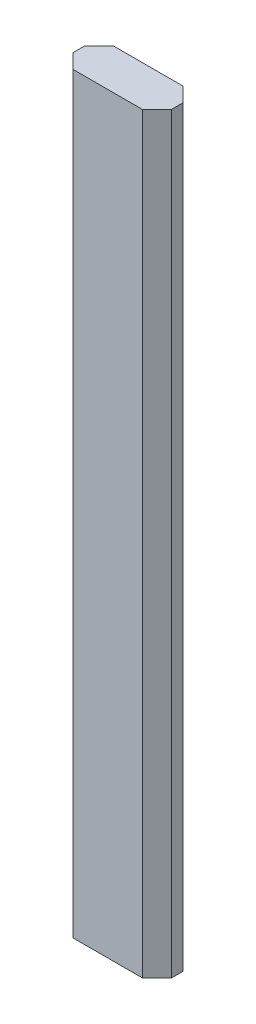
ISO-10303-21;
HEADER;
FILE_DESCRIPTION(('STEP AP214'),'2;1');
FILE_NAME('part.step','',(''),(''),'','','');
FILE_SCHEMA(('AUTOMOTIVE_DESIGN { 1 0 10303 214 1 1 1 1 }'));
ENDSEC;
DATA;
#1=APPLICATION_CONTEXT('core data for automotive mechanical design processes');
#2=APPLICATION_PROTOCOL_DEFINITION('international standard','automotive_design',2000,#1);
#3=PRODUCT_CONTEXT('',#1,'mechanical');
#4=PRODUCT('Part','Part','',(#3));
#5=PRODUCT_RELATED_PRODUCT_CATEGORY('part','',(#4));
#6=PRODUCT_DEFINITION_FORMATION('','',#4);
#7=PRODUCT_DEFINITION_CONTEXT('part definition',#1,'design');
#8=PRODUCT_DEFINITION('design','',#6,#7);
#9=PRODUCT_DEFINITION_SHAPE('','',#8);
#10=(LENGTH_UNIT() NAMED_UNIT(*) SI_UNIT(.MILLI.,.METRE.));
#11=(NAMED_UNIT(*) PLANE_ANGLE_UNIT() SI_UNIT($,.RADIAN.));
#12=(NAMED_UNIT(*) SI_UNIT($,.STERADIAN.) SOLID_ANGLE_UNIT());
#13=UNCERTAINTY_MEASURE_WITH_UNIT(LENGTH_MEASURE(1.E-05),#10,'distance_accuracy_value','');
#14=(GEOMETRIC_REPRESENTATION_CONTEXT(3) GLOBAL_UNCERTAINTY_ASSIGNED_CONTEXT((#13)) GLOBAL_UNIT_ASSIGNED_CONTEXT((#10,
#11,#12)) REPRESENTATION_CONTEXT('',''));
#15=CARTESIAN_POINT('',(0.,0.,0.));
#16=DIRECTION('',(0.,0.,1.));
#17=DIRECTION('',(1.,0.,0.));
#18=AXIS2_PLACEMENT_3D('',#15,#16,#17);
#19=CARTESIAN_POINT('',(-111.749922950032,130.,-50.1029826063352));
#20=DIRECTION('',(1.,0.,0.));
#21=DIRECTION('',(0.,0.,-1.));
#22=AXIS2_PLACEMENT_3D('',#19,#20,#21);
#23=PLANE('',#22);
#24=DIRECTION('',(0.,0.,1.));
#25=VECTOR('',#24,1.);
#26=CARTESIAN_POINT('',(-111.749922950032,0.,-50.1029826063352));
#27=LINE('',#26,#25);
#28=CARTESIAN_POINT('',(-111.749922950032,0.,-54.6029826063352));
#29=VERTEX_POINT('',#28);
#30=CARTESIAN_POINT('',(-111.749922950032,0.,-52.6029826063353));
#31=VERTEX_POINT('',#30);
#32=EDGE_CURVE('E163',#29,#31,#27,.T.);
#33=ORIENTED_EDGE('',*,*,#32,.T.);
#34=DIRECTION('',(0.,1.,0.));
#35=VECTOR('',#34,1.);
#36=CARTESIAN_POINT('',(-111.749922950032,130.,-52.6029826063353));
#37=LINE('',#36,#35);
#38=CARTESIAN_POINT('',(-111.749922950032,130.,-52.6029826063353));
#39=VERTEX_POINT('',#38);
#40=EDGE_CURVE('E203',#31,#39,#37,.T.);
#41=ORIENTED_EDGE('',*,*,#40,.T.);
#42=DIRECTION('',(0.,0.,1.));
#43=VECTOR('',#42,1.);
#44=CARTESIAN_POINT('',(-111.749922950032,130.,-50.1029826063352));
#45=LINE('',#44,#43);
#46=CARTESIAN_POINT('',(-111.749922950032,130.,-54.6029826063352));
#47=VERTEX_POINT('',#46);
#48=EDGE_CURVE('E167',#47,#39,#45,.T.);
#49=ORIENTED_EDGE('',*,*,#48,.F.);
#50=DIRECTION('',(0.,-1.,0.));
#51=VECTOR('',#50,1.);
#52=CARTESIAN_POINT('',(-111.749922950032,130.,-54.6029826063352));
#53=LINE('',#52,#51);
#54=EDGE_CURVE('E200',#47,#29,#53,.T.);
#55=ORIENTED_EDGE('',*,*,#54,.T.);
#56=EDGE_LOOP('',(#33,#41,#49,#55));
#57=FACE_BOUND('',#56,.T.);
#58=ADVANCED_FACE('F34',(#57),#23,.F.);
#59=CARTESIAN_POINT('',(-94.7499229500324,130.,-50.1029826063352));
#60=DIRECTION('',(0.,0.,-1.));
#61=DIRECTION('',(-1.,0.,0.));
#62=AXIS2_PLACEMENT_3D('',#59,#60,#61);
#63=PLANE('',#62);
#64=DIRECTION('',(1.,0.,0.));
#65=VECTOR('',#64,1.);
#66=CARTESIAN_POINT('',(-94.7499229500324,130.,-50.1029826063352));
#67=LINE('',#66,#65);
#68=CARTESIAN_POINT('',(-109.249922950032,130.,-50.1029826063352));
#69=VERTEX_POINT('',#68);
#70=CARTESIAN_POINT('',(-97.2499229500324,130.,-50.1029826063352));
#71=VERTEX_POINT('',#70);
#72=EDGE_CURVE('E170',#69,#71,#67,.T.);
#73=ORIENTED_EDGE('',*,*,#72,.F.);
#74=DIRECTION('',(0.,-1.,0.));
#75=VECTOR('',#74,1.);
#76=CARTESIAN_POINT('',(-109.249922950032,130.,-50.1029826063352));
#77=LINE('',#76,#75);
#78=CARTESIAN_POINT('',(-109.249922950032,0.,-50.1029826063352));
#79=VERTEX_POINT('',#78);
#80=EDGE_CURVE('E189',#69,#79,#77,.T.);
#81=ORIENTED_EDGE('',*,*,#80,.T.);
#82=DIRECTION('',(1.,0.,0.));
#83=VECTOR('',#82,1.);
#84=CARTESIAN_POINT('',(-94.7499229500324,0.,-50.1029826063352));
#85=LINE('',#84,#83);
#86=CARTESIAN_POINT('',(-97.2499229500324,0.,-50.1029826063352));
#87=VERTEX_POINT('',#86);
#88=EDGE_CURVE('E181',#79,#87,#85,.T.);
#89=ORIENTED_EDGE('',*,*,#88,.T.);
#90=DIRECTION('',(0.,1.,0.));
#91=VECTOR('',#90,1.);
#92=CARTESIAN_POINT('',(-97.2499229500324,130.,-50.1029826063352));
#93=LINE('',#92,#91);
#94=EDGE_CURVE('E178',#87,#71,#93,.T.);
#95=ORIENTED_EDGE('',*,*,#94,.T.);
#96=EDGE_LOOP('',(#73,#81,#89,#95));
#97=FACE_BOUND('',#96,.T.);
#98=ADVANCED_FACE('F247',(#97),#63,.F.);
#99=CARTESIAN_POINT('',(-94.7499229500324,130.,-57.1029826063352));
#100=DIRECTION('',(-1.,0.,0.));
#101=DIRECTION('',(0.,0.,1.));
#102=AXIS2_PLACEMENT_3D('',#99,#100,#101);
#103=PLANE('',#102);
#104=DIRECTION('',(0.,0.,-1.));
#105=VECTOR('',#104,1.);
#106=CARTESIAN_POINT('',(-94.7499229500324,0.,-57.1029826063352));
#107=LINE('',#106,#105);
#108=CARTESIAN_POINT('',(-94.7499229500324,0.,-52.6029826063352));
#109=VERTEX_POINT('',#108);
#110=CARTESIAN_POINT('',(-94.7499229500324,0.,-54.6029826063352));
#111=VERTEX_POINT('',#110);
#112=EDGE_CURVE('E184',#109,#111,#107,.T.);
#113=ORIENTED_EDGE('',*,*,#112,.T.);
#114=DIRECTION('',(0.,1.,0.));
#115=VECTOR('',#114,1.);
#116=CARTESIAN_POINT('',(-94.7499229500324,130.,-54.6029826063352));
#117=LINE('',#116,#115);
#118=CARTESIAN_POINT('',(-94.7499229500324,130.,-54.6029826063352));
#119=VERTEX_POINT('',#118);
#120=EDGE_CURVE('E11',#111,#119,#117,.T.);
#121=ORIENTED_EDGE('',*,*,#120,.T.);
#122=DIRECTION('',(0.,0.,-1.));
#123=VECTOR('',#122,1.);
#124=CARTESIAN_POINT('',(-94.7499229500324,130.,-57.1029826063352));
#125=LINE('',#124,#123);
#126=CARTESIAN_POINT('',(-94.7499229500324,130.,-52.6029826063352));
#127=VERTEX_POINT('',#126);
#128=EDGE_CURVE('E174',#127,#119,#125,.T.);
#129=ORIENTED_EDGE('',*,*,#128,.F.);
#130=DIRECTION('',(0.,-1.,0.));
#131=VECTOR('',#130,1.);
#132=CARTESIAN_POINT('',(-94.7499229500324,130.,-52.6029826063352));
#133=LINE('',#132,#131);
#134=EDGE_CURVE('E42',#127,#109,#133,.T.);
#135=ORIENTED_EDGE('',*,*,#134,.T.);
#136=EDGE_LOOP('',(#113,#121,#129,#135));
#137=FACE_BOUND('',#136,.T.);
#138=ADVANCED_FACE('F220',(#137),#103,.F.);
#139=CARTESIAN_POINT('',(-111.749922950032,130.,-57.1029826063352));
#140=DIRECTION('',(0.,0.,1.));
#141=DIRECTION('',(1.,0.,0.));
#142=AXIS2_PLACEMENT_3D('',#139,#140,#141);
#143=PLANE('',#142);
#144=DIRECTION('',(-1.,0.,0.));
#145=VECTOR('',#144,1.);
#146=CARTESIAN_POINT('',(-111.749922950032,0.,-57.1029826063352));
#147=LINE('',#146,#145);
#148=CARTESIAN_POINT('',(-97.2499229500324,0.,-57.1029826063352));
#149=VERTEX_POINT('',#148);
#150=CARTESIAN_POINT('',(-109.249922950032,0.,-57.1029826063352));
#151=VERTEX_POINT('',#150);
#152=EDGE_CURVE('E171',#149,#151,#147,.T.);
#153=ORIENTED_EDGE('',*,*,#152,.T.);
#154=DIRECTION('',(0.,1.,0.));
#155=VECTOR('',#154,1.);
#156=CARTESIAN_POINT('',(-109.249922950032,130.,-57.1029826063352));
#157=LINE('',#156,#155);
#158=CARTESIAN_POINT('',(-109.249922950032,130.,-57.1029826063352));
#159=VERTEX_POINT('',#158);
#160=EDGE_CURVE('E49',#151,#159,#157,.T.);
#161=ORIENTED_EDGE('',*,*,#160,.T.);
#162=DIRECTION('',(-1.,0.,0.));
#163=VECTOR('',#162,1.);
#164=CARTESIAN_POINT('',(-111.749922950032,130.,-57.1029826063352));
#165=LINE('',#164,#163);
#166=CARTESIAN_POINT('',(-97.2499229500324,130.,-57.1029826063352));
#167=VERTEX_POINT('',#166);
#168=EDGE_CURVE('E176',#167,#159,#165,.T.);
#169=ORIENTED_EDGE('',*,*,#168,.F.);
#170=DIRECTION('',(0.,-1.,0.));
#171=VECTOR('',#170,1.);
#172=CARTESIAN_POINT('',(-97.2499229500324,130.,-57.1029826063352));
#173=LINE('',#172,#171);
#174=EDGE_CURVE('E212',#167,#149,#173,.T.);
#175=ORIENTED_EDGE('',*,*,#174,.T.);
#176=EDGE_LOOP('',(#153,#161,#169,#175));
#177=FACE_BOUND('',#176,.T.);
#178=ADVANCED_FACE('F231',(#177),#143,.F.);
#179=CARTESIAN_POINT('',(0.,130.,0.));
#180=DIRECTION('',(0.,-1.,0.));
#181=DIRECTION('',(0.,0.,-1.));
#182=AXIS2_PLACEMENT_3D('',#179,#180,#181);
#183=PLANE('',#182);
#184=ORIENTED_EDGE('',*,*,#48,.T.);
#185=DIRECTION('',(-0.707106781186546,0.,-0.70710678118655));
#186=VECTOR('',#185,1.);
#187=CARTESIAN_POINT('',(-109.249922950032,130.,-50.1029826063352));
#188=LINE('',#187,#186);
#189=EDGE_CURVE('E210',#39,#69,#188,.F.);
#190=ORIENTED_EDGE('',*,*,#189,.T.);
#191=ORIENTED_EDGE('',*,*,#72,.T.);
#192=DIRECTION('',(-0.707106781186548,0.,0.707106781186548));
#193=VECTOR('',#192,1.);
#194=CARTESIAN_POINT('',(-94.7499229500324,130.,-52.6029826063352));
#195=LINE('',#194,#193);
#196=EDGE_CURVE('E205',#71,#127,#195,.F.);
#197=ORIENTED_EDGE('',*,*,#196,.T.);
#198=ORIENTED_EDGE('',*,*,#128,.T.);
#199=DIRECTION('',(0.707106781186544,0.,0.707106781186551));
#200=VECTOR('',#199,1.);
#201=CARTESIAN_POINT('',(-97.2499229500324,130.,-57.1029826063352));
#202=LINE('',#201,#200);
#203=EDGE_CURVE('E56',#119,#167,#202,.F.);
#204=ORIENTED_EDGE('',*,*,#203,.T.);
#205=ORIENTED_EDGE('',*,*,#168,.T.);
#206=DIRECTION('',(0.707106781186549,0.,-0.707106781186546));
#207=VECTOR('',#206,1.);
#208=CARTESIAN_POINT('',(-111.749922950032,130.,-54.6029826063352));
#209=LINE('',#208,#207);
#210=EDGE_CURVE('E208',#159,#47,#209,.F.);
#211=ORIENTED_EDGE('',*,*,#210,.T.);
#212=EDGE_LOOP('',(#184,#190,#191,#197,#198,#204,#205,#211));
#213=FACE_BOUND('',#212,.T.);
#214=ADVANCED_FACE('F233',(#213),#183,.F.);
#215=CARTESIAN_POINT('',(0.,0.,0.));
#216=DIRECTION('',(0.,-1.,0.));
#217=DIRECTION('',(0.,0.,-1.));
#218=AXIS2_PLACEMENT_3D('',#215,#216,#217);
#219=PLANE('',#218);
#220=DIRECTION('',(0.,0.,1.));
#221=VECTOR('',#220,1.);
#222=CARTESIAN_POINT('',(-97.2499229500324,0.,0.));
#223=LINE('',#222,#221);
#224=CARTESIAN_POINT('',(-97.2499229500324,0.,-55.6029826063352));
#225=VERTEX_POINT('',#224);
#226=CARTESIAN_POINT('',(-97.2499229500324,0.,-51.6029826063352));
#227=VERTEX_POINT('',#226);
#228=EDGE_CURVE('E143',#225,#227,#223,.T.);
#229=ORIENTED_EDGE('',*,*,#228,.F.);
#230=DIRECTION('',(1.,0.,0.));
#231=VECTOR('',#230,1.);
#232=CARTESIAN_POINT('',(0.,0.,-55.6029826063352));
#233=LINE('',#232,#231);
#234=CARTESIAN_POINT('',(-109.249922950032,0.,-55.6029826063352));
#235=VERTEX_POINT('',#234);
#236=EDGE_CURVE('E148',#235,#225,#233,.T.);
#237=ORIENTED_EDGE('',*,*,#236,.F.);
#238=DIRECTION('',(0.,0.,1.));
#239=VECTOR('',#238,1.);
#240=CARTESIAN_POINT('',(-109.249922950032,0.,0.));
#241=LINE('',#240,#239);
#242=CARTESIAN_POINT('',(-109.249922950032,0.,-51.6029826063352));
#243=VERTEX_POINT('',#242);
#244=EDGE_CURVE('E151',#235,#243,#241,.T.);
#245=ORIENTED_EDGE('',*,*,#244,.T.);
#246=DIRECTION('',(1.,0.,0.));
#247=VECTOR('',#246,1.);
#248=CARTESIAN_POINT('',(0.,0.,-51.6029826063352));
#249=LINE('',#248,#247);
#250=EDGE_CURVE('E157',#243,#227,#249,.T.);
#251=ORIENTED_EDGE('',*,*,#250,.T.);
#252=EDGE_LOOP('',(#229,#237,#245,#251));
#253=FACE_BOUND('',#252,.T.);
#254=ORIENTED_EDGE('',*,*,#88,.F.);
#255=DIRECTION('',(0.707106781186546,0.,0.70710678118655));
#256=VECTOR('',#255,1.);
#257=CARTESIAN_POINT('',(-29.5734701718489,0.,29.5734701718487));
#258=LINE('',#257,#256);
#259=EDGE_CURVE('E198',#79,#31,#258,.F.);
#260=ORIENTED_EDGE('',*,*,#259,.T.);
#261=ORIENTED_EDGE('',*,*,#32,.F.);
#262=DIRECTION('',(-0.707106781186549,0.,0.707106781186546));
#263=VECTOR('',#262,1.);
#264=CARTESIAN_POINT('',(-83.1764527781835,0.,-83.176452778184));
#265=LINE('',#264,#263);
#266=EDGE_CURVE('E196',#29,#151,#265,.F.);
#267=ORIENTED_EDGE('',*,*,#266,.T.);
#268=ORIENTED_EDGE('',*,*,#152,.F.);
#269=DIRECTION('',(-0.707106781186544,0.,-0.707106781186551));
#270=VECTOR('',#269,1.);
#271=CARTESIAN_POINT('',(-20.0734701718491,0.,20.0734701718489));
#272=LINE('',#271,#270);
#273=EDGE_CURVE('E194',#149,#111,#272,.F.);
#274=ORIENTED_EDGE('',*,*,#273,.T.);
#275=ORIENTED_EDGE('',*,*,#112,.F.);
#276=DIRECTION('',(0.707106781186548,0.,-0.707106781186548));
#277=VECTOR('',#276,1.);
#278=CARTESIAN_POINT('',(-73.6764527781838,0.,-73.6764527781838));
#279=LINE('',#278,#277);
#280=EDGE_CURVE('E192',#109,#87,#279,.F.);
#281=ORIENTED_EDGE('',*,*,#280,.T.);
#282=EDGE_LOOP('',(#254,#260,#261,#267,#268,#274,#275,#281));
#283=FACE_BOUND('',#282,.T.);
#284=ADVANCED_FACE('F226',(#253,#283),#219,.T.);
#285=CARTESIAN_POINT('',(-97.2499229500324,120.,0.));
#286=DIRECTION('',(1.,0.,0.));
#287=DIRECTION('',(0.,0.,-1.));
#288=AXIS2_PLACEMENT_3D('',#285,#286,#287);
#289=PLANE('',#288);
#290=ORIENTED_EDGE('',*,*,#228,.T.);
#291=DIRECTION('',(0.,-1.,0.));
#292=VECTOR('',#291,1.);
#293=CARTESIAN_POINT('',(-97.2499229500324,120.,-51.6029826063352));
#294=LINE('',#293,#292);
#295=CARTESIAN_POINT('',(-97.2499229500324,120.,-51.6029826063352));
#296=VERTEX_POINT('',#295);
#297=EDGE_CURVE('E129',#296,#227,#294,.T.);
#298=ORIENTED_EDGE('',*,*,#297,.F.);
#299=DIRECTION('',(0.,0.,1.));
#300=VECTOR('',#299,1.);
#301=CARTESIAN_POINT('',(-97.2499229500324,120.,0.));
#302=LINE('',#301,#300);
#303=CARTESIAN_POINT('',(-97.2499229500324,120.,-55.6029826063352));
#304=VERTEX_POINT('',#303);
#305=EDGE_CURVE('E136',#304,#296,#302,.T.);
#306=ORIENTED_EDGE('',*,*,#305,.F.);
#307=DIRECTION('',(0.,-1.,0.));
#308=VECTOR('',#307,1.);
#309=CARTESIAN_POINT('',(-97.2499229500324,120.,-55.6029826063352));
#310=LINE('',#309,#308);
#311=EDGE_CURVE('E161',#304,#225,#310,.T.);
#312=ORIENTED_EDGE('',*,*,#311,.T.);
#313=EDGE_LOOP('',(#290,#298,#306,#312));
#314=FACE_BOUND('',#313,.T.);
#315=ADVANCED_FACE('F140',(#314),#289,.F.);
#316=CARTESIAN_POINT('',(0.,120.,-55.6029826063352));
#317=DIRECTION('',(0.,0.,-1.));
#318=DIRECTION('',(-1.,0.,0.));
#319=AXIS2_PLACEMENT_3D('',#316,#317,#318);
#320=PLANE('',#319);
#321=ORIENTED_EDGE('',*,*,#236,.T.);
#322=ORIENTED_EDGE('',*,*,#311,.F.);
#323=DIRECTION('',(1.,0.,0.));
#324=VECTOR('',#323,1.);
#325=CARTESIAN_POINT('',(0.,120.,-55.6029826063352));
#326=LINE('',#325,#324);
#327=CARTESIAN_POINT('',(-109.249922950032,120.,-55.6029826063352));
#328=VERTEX_POINT('',#327);
#329=EDGE_CURVE('E144',#328,#304,#326,.T.);
#330=ORIENTED_EDGE('',*,*,#329,.F.);
#331=DIRECTION('',(0.,-1.,0.));
#332=VECTOR('',#331,1.);
#333=CARTESIAN_POINT('',(-109.249922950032,120.,-55.6029826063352));
#334=LINE('',#333,#332);
#335=EDGE_CURVE('E164',#328,#235,#334,.T.);
#336=ORIENTED_EDGE('',*,*,#335,.T.);
#337=EDGE_LOOP('',(#321,#322,#330,#336));
#338=FACE_BOUND('',#337,.T.);
#339=ADVANCED_FACE('F349',(#338),#320,.F.);
#340=CARTESIAN_POINT('',(-109.249922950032,120.,0.));
#341=DIRECTION('',(1.,0.,0.));
#342=DIRECTION('',(0.,0.,-1.));
#343=AXIS2_PLACEMENT_3D('',#340,#341,#342);
#344=PLANE('',#343);
#345=ORIENTED_EDGE('',*,*,#244,.F.);
#346=ORIENTED_EDGE('',*,*,#335,.F.);
#347=DIRECTION('',(0.,0.,1.));
#348=VECTOR('',#347,1.);
#349=CARTESIAN_POINT('',(-109.249922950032,120.,0.));
#350=LINE('',#349,#348);
#351=CARTESIAN_POINT('',(-109.249922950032,120.,-51.6029826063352));
#352=VERTEX_POINT('',#351);
#353=EDGE_CURVE('E135',#328,#352,#350,.T.);
#354=ORIENTED_EDGE('',*,*,#353,.T.);
#355=DIRECTION('',(0.,-1.,0.));
#356=VECTOR('',#355,1.);
#357=CARTESIAN_POINT('',(-109.249922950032,120.,-51.6029826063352));
#358=LINE('',#357,#356);
#359=EDGE_CURVE('E131',#352,#243,#358,.T.);
#360=ORIENTED_EDGE('',*,*,#359,.T.);
#361=EDGE_LOOP('',(#345,#346,#354,#360));
#362=FACE_BOUND('',#361,.T.);
#363=ADVANCED_FACE('F355',(#362),#344,.T.);
#364=CARTESIAN_POINT('',(0.,120.,-51.6029826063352));
#365=DIRECTION('',(0.,0.,-1.));
#366=DIRECTION('',(-1.,0.,0.));
#367=AXIS2_PLACEMENT_3D('',#364,#365,#366);
#368=PLANE('',#367);
#369=ORIENTED_EDGE('',*,*,#250,.F.);
#370=ORIENTED_EDGE('',*,*,#359,.F.);
#371=DIRECTION('',(1.,0.,0.));
#372=VECTOR('',#371,1.);
#373=CARTESIAN_POINT('',(0.,120.,-51.6029826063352));
#374=LINE('',#373,#372);
#375=EDGE_CURVE('E125',#352,#296,#374,.T.);
#376=ORIENTED_EDGE('',*,*,#375,.T.);
#377=ORIENTED_EDGE('',*,*,#297,.T.);
#378=EDGE_LOOP('',(#369,#370,#376,#377));
#379=FACE_BOUND('',#378,.T.);
#380=ADVANCED_FACE('F128',(#379),#368,.T.);
#381=CARTESIAN_POINT('',(0.,120.,0.));
#382=DIRECTION('',(0.,-1.,0.));
#383=DIRECTION('',(0.,0.,-1.));
#384=AXIS2_PLACEMENT_3D('',#381,#382,#383);
#385=PLANE('',#384);
#386=ORIENTED_EDGE('',*,*,#305,.T.);
#387=ORIENTED_EDGE('',*,*,#375,.F.);
#388=ORIENTED_EDGE('',*,*,#353,.F.);
#389=ORIENTED_EDGE('',*,*,#329,.T.);
#390=EDGE_LOOP('',(#386,#387,#388,#389));
#391=FACE_BOUND('',#390,.T.);
#392=ADVANCED_FACE('F146',(#391),#385,.T.);
#393=CARTESIAN_POINT('',(-109.249922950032,130.,-50.1029826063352));
#394=DIRECTION('',(0.707106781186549,0.,-0.707106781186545));
#395=DIRECTION('',(0.,-1.,0.));
#396=AXIS2_PLACEMENT_3D('',#393,#394,#395);
#397=PLANE('',#396);
#398=ORIENTED_EDGE('',*,*,#189,.F.);
#399=ORIENTED_EDGE('',*,*,#40,.F.);
#400=ORIENTED_EDGE('',*,*,#259,.F.);
#401=ORIENTED_EDGE('',*,*,#80,.F.);
#402=EDGE_LOOP('',(#398,#399,#400,#401));
#403=FACE_BOUND('',#402,.T.);
#404=ADVANCED_FACE('F244',(#403),#397,.F.);
#405=CARTESIAN_POINT('',(-111.749922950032,130.,-54.6029826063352));
#406=DIRECTION('',(0.707106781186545,0.,0.707106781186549));
#407=DIRECTION('',(0.,-1.,0.));
#408=AXIS2_PLACEMENT_3D('',#405,#406,#407);
#409=PLANE('',#408);
#410=ORIENTED_EDGE('',*,*,#210,.F.);
#411=ORIENTED_EDGE('',*,*,#160,.F.);
#412=ORIENTED_EDGE('',*,*,#266,.F.);
#413=ORIENTED_EDGE('',*,*,#54,.F.);
#414=EDGE_LOOP('',(#410,#411,#412,#413));
#415=FACE_BOUND('',#414,.T.);
#416=ADVANCED_FACE('F237',(#415),#409,.F.);
#417=CARTESIAN_POINT('',(-97.2499229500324,130.,-57.1029826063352));
#418=DIRECTION('',(-0.707106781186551,0.,0.707106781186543));
#419=DIRECTION('',(0.,-1.,0.));
#420=AXIS2_PLACEMENT_3D('',#417,#418,#419);
#421=PLANE('',#420);
#422=ORIENTED_EDGE('',*,*,#203,.F.);
#423=ORIENTED_EDGE('',*,*,#120,.F.);
#424=ORIENTED_EDGE('',*,*,#273,.F.);
#425=ORIENTED_EDGE('',*,*,#174,.F.);
#426=EDGE_LOOP('',(#422,#423,#424,#425));
#427=FACE_BOUND('',#426,.T.);
#428=ADVANCED_FACE('F230',(#427),#421,.F.);
#429=CARTESIAN_POINT('',(-94.7499229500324,130.,-52.6029826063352));
#430=DIRECTION('',(-0.707106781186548,0.,-0.707106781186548));
#431=DIRECTION('',(0.,-1.,0.));
#432=AXIS2_PLACEMENT_3D('',#429,#430,#431);
#433=PLANE('',#432);
#434=ORIENTED_EDGE('',*,*,#196,.F.);
#435=ORIENTED_EDGE('',*,*,#94,.F.);
#436=ORIENTED_EDGE('',*,*,#280,.F.);
#437=ORIENTED_EDGE('',*,*,#134,.F.);
#438=EDGE_LOOP('',(#434,#435,#436,#437));
#439=FACE_BOUND('',#438,.T.);
#440=ADVANCED_FACE('F36',(#439),#433,.F.);
#441=CLOSED_SHELL('',(#58,#98,#138,#178,#214,#284,#315,#339,#363,#380,#392,#404,#416,#428,#440));
#442=MANIFOLD_SOLID_BREP('B2',#441);
#443=ADVANCED_BREP_SHAPE_REPRESENTATION('',(#18,#442),#14);
#444=SHAPE_DEFINITION_REPRESENTATION(#9,#443);
ENDSEC;
END-ISO-10303-21;
